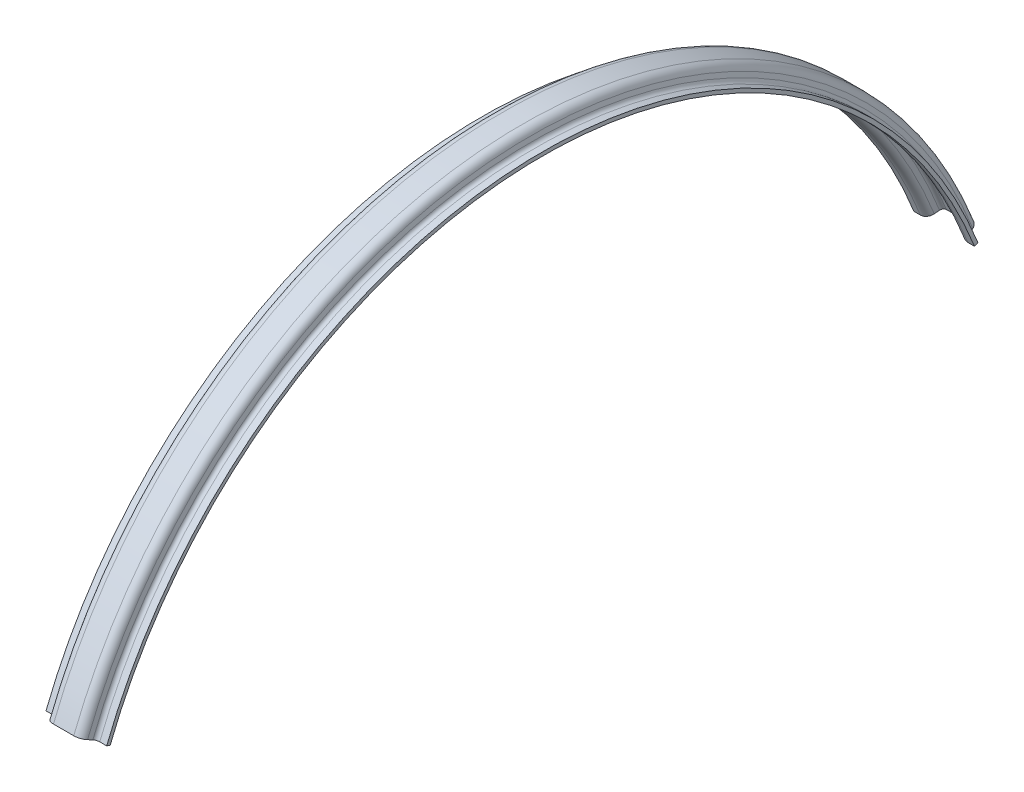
from build123d import *

# Parameters (mm, degrees)
BASE_REVOLVE_ANGLE = 137


with BuildPart() as part:
    # Sketch2 → Base-Revolve (revolve, symmetric)
    with BuildSketch(Plane.XY) as base_revolve_sk:
        with BuildLine():
            Line((-5.556689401, 264.286999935), (5.556689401, 264.286999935))
            ThreePointArc((5.556689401, 264.286999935), (8.339946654, 263.342211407), (9.972902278, 260.898320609))
            Line((9.972902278, 260.898320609), (10.625460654, 258.462939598))
            ThreePointArc((10.625460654, 258.462939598), (11.441938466, 257.240994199), (12.833567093, 256.768599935))
            Line((12.833567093, 256.768599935), (16.637, 256.768599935))
            Line((16.637, 256.768599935), (16.637, 254.7366))
            Line((16.637, 254.7366), (13.028468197, 254.7366))
            ThreePointArc((13.028468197, 254.7366), (10.245210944, 255.681388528), (8.61225532, 258.125279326))
            Line((8.61225532, 258.125279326), (7.959696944, 260.560660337))
            ThreePointArc((7.959696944, 260.560660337), (7.143219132, 261.782605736), (5.751590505, 262.255))
            Line((5.751590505, 262.255), (-5.751590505, 262.255))
            ThreePointArc((-5.751590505, 262.255), (-7.143219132, 261.782605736), (-7.959696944, 260.560660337))
            Line((-7.959696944, 260.560660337), (-8.61225532, 258.125279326))
            ThreePointArc((-8.61225532, 258.125279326), (-10.245210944, 255.681388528), (-13.028468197, 254.7366))
            Line((-13.028468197, 254.7366), (-16.637, 254.7366))
            Line((-16.637, 254.7366), (-16.637, 256.768599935))
            Line((-16.637, 256.768599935), (-12.833567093, 256.768599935))
            ThreePointArc((-12.833567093, 256.768599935), (-11.441938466, 257.240994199), (-10.625460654, 258.462939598))
            Line((-10.625460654, 258.462939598), (-9.972902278, 260.898320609))
            ThreePointArc((-9.972902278, 260.898320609), (-8.339946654, 263.342211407), (-5.556689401, 264.286999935))
        make_face()
    revolve(axis=Axis((82.873490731, 0, 0), (-1, 0, 0)), revolution_arc=BASE_REVOLVE_ANGLE / 2)
    revolve(base_revolve_sk.sketch, axis=Axis((82.873490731, 0, 0), (1, 0, 0)), revolution_arc=BASE_REVOLVE_ANGLE / 2)


solid = part.part
